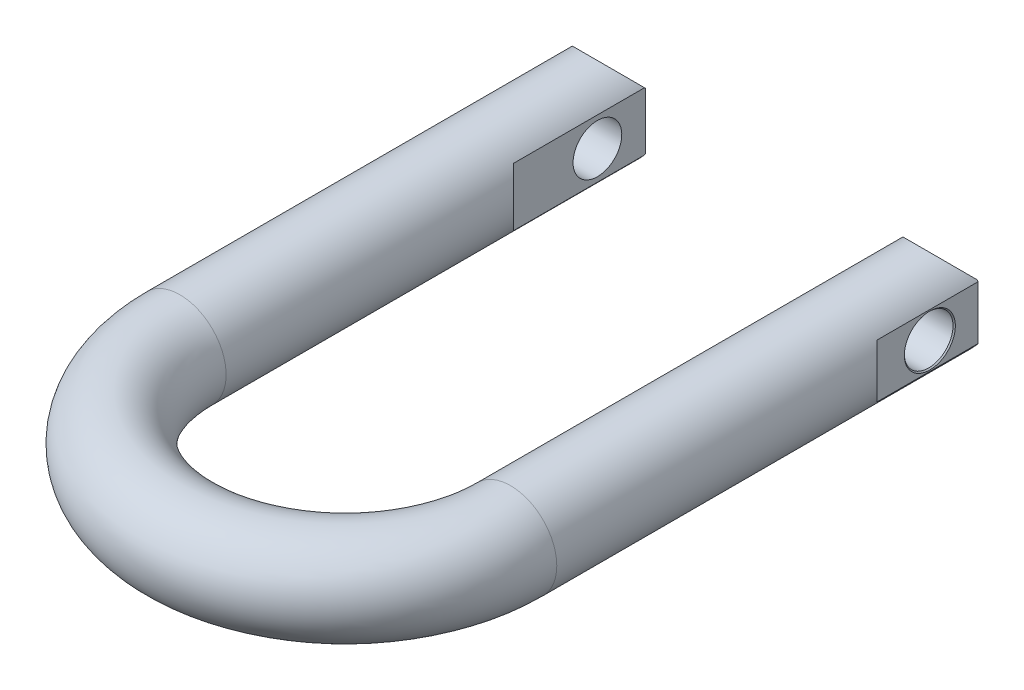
ISO-10303-21;
HEADER;
FILE_DESCRIPTION(('STEP AP214'),'2;1');
FILE_NAME('part.step','',(''),(''),'','','');
FILE_SCHEMA(('AUTOMOTIVE_DESIGN { 1 0 10303 214 1 1 1 1 }'));
ENDSEC;
DATA;
#1=APPLICATION_CONTEXT('core data for automotive mechanical design processes');
#2=APPLICATION_PROTOCOL_DEFINITION('international standard','automotive_design',2000,#1);
#3=PRODUCT_CONTEXT('',#1,'mechanical');
#4=PRODUCT('Part','Part','',(#3));
#5=PRODUCT_RELATED_PRODUCT_CATEGORY('part','',(#4));
#6=PRODUCT_DEFINITION_FORMATION('','',#4);
#7=PRODUCT_DEFINITION_CONTEXT('part definition',#1,'design');
#8=PRODUCT_DEFINITION('design','',#6,#7);
#9=PRODUCT_DEFINITION_SHAPE('','',#8);
#10=(LENGTH_UNIT() NAMED_UNIT(*) SI_UNIT(.MILLI.,.METRE.));
#11=(NAMED_UNIT(*) PLANE_ANGLE_UNIT() SI_UNIT($,.RADIAN.));
#12=(NAMED_UNIT(*) SI_UNIT($,.STERADIAN.) SOLID_ANGLE_UNIT());
#13=UNCERTAINTY_MEASURE_WITH_UNIT(LENGTH_MEASURE(1.E-05),#10,'distance_accuracy_value','');
#14=(GEOMETRIC_REPRESENTATION_CONTEXT(3) GLOBAL_UNCERTAINTY_ASSIGNED_CONTEXT((#13)) GLOBAL_UNIT_ASSIGNED_CONTEXT((#10,
#11,#12)) REPRESENTATION_CONTEXT('',''));
#15=CARTESIAN_POINT('',(0.,0.,0.));
#16=DIRECTION('',(0.,0.,1.));
#17=DIRECTION('',(1.,0.,0.));
#18=AXIS2_PLACEMENT_3D('',#15,#16,#17);
#19=CARTESIAN_POINT('',(96.9518,0.,0.));
#20=DIRECTION('',(-1.,0.,0.));
#21=DIRECTION('',(0.,0.,1.));
#22=AXIS2_PLACEMENT_3D('',#19,#20,#21);
#23=CYLINDRICAL_SURFACE('',#22,11.6967);
#24=CARTESIAN_POINT('',(62.1284,0.,0.));
#25=DIRECTION('',(-1.,0.,0.));
#26=DIRECTION('',(0.,0.,1.));
#27=AXIS2_PLACEMENT_3D('',#24,#25,#26);
#28=CIRCLE('',#27,11.6967);
#29=CARTESIAN_POINT('',(62.1284,0.,11.6967));
#30=VERTEX_POINT('',#29);
#31=EDGE_CURVE('E182',#30,#30,#28,.T.);
#32=ORIENTED_EDGE('',*,*,#31,.T.);
#33=EDGE_LOOP('',(#32));
#34=FACE_BOUND('',#33,.T.);
#35=CARTESIAN_POINT('',(96.9518,0.,0.));
#36=DIRECTION('',(-1.,0.,0.));
#37=DIRECTION('',(0.,-1.,0.));
#38=AXIS2_PLACEMENT_3D('',#35,#36,#37);
#39=CIRCLE('',#38,11.6967);
#40=CARTESIAN_POINT('',(96.9518,-11.6967,0.));
#41=VERTEX_POINT('',#40);
#42=EDGE_CURVE('E156',#41,#41,#39,.F.);
#43=ORIENTED_EDGE('',*,*,#42,.T.);
#44=EDGE_LOOP('',(#43));
#45=FACE_BOUND('',#44,.T.);
#46=ADVANCED_FACE('F14',(#34,#45),#23,.F.);
#47=CARTESIAN_POINT('',(96.9518,0.,0.));
#48=DIRECTION('',(1.,0.,0.));
#49=DIRECTION('',(0.,0.,-1.));
#50=AXIS2_PLACEMENT_3D('',#47,#48,#49);
#51=CONICAL_SURFACE('',#50,11.6967,0.785398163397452);
#52=CARTESIAN_POINT('',(97.5105999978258,0.,0.));
#53=DIRECTION('',(-1.,0.,0.));
#54=DIRECTION('',(0.,0.,1.));
#55=AXIS2_PLACEMENT_3D('',#52,#53,#54);
#56=CIRCLE('',#55,12.2554999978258);
#57=CARTESIAN_POINT('',(97.5105999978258,0.,12.2554999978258));
#58=VERTEX_POINT('',#57);
#59=EDGE_CURVE('E312',#58,#58,#56,.T.);
#60=ORIENTED_EDGE('',*,*,#59,.F.);
#61=EDGE_LOOP('',(#60));
#62=FACE_BOUND('',#61,.T.);
#63=ORIENTED_EDGE('',*,*,#42,.F.);
#64=EDGE_LOOP('',(#63));
#65=FACE_BOUND('',#64,.T.);
#66=ADVANCED_FACE('F269',(#62,#65),#51,.F.);
#67=CARTESIAN_POINT('',(-62.1284,0.,0.));
#68=DIRECTION('',(-1.,0.,0.));
#69=DIRECTION('',(0.,-1.,0.));
#70=AXIS2_PLACEMENT_3D('',#67,#68,#69);
#71=CYLINDRICAL_SURFACE('',#70,11.6967);
#72=CARTESIAN_POINT('',(-62.1284,0.,0.));
#73=DIRECTION('',(-1.,0.,0.));
#74=DIRECTION('',(0.,-1.,0.));
#75=AXIS2_PLACEMENT_3D('',#72,#73,#74);
#76=CIRCLE('',#75,11.6967);
#77=CARTESIAN_POINT('',(-62.1284,-11.6967,0.));
#78=VERTEX_POINT('',#77);
#79=EDGE_CURVE('E144',#78,#78,#76,.F.);
#80=ORIENTED_EDGE('',*,*,#79,.T.);
#81=EDGE_LOOP('',(#80));
#82=FACE_BOUND('',#81,.T.);
#83=CARTESIAN_POINT('',(-96.9518,0.,0.));
#84=DIRECTION('',(-1.,0.,0.));
#85=DIRECTION('',(0.,-1.,0.));
#86=AXIS2_PLACEMENT_3D('',#83,#84,#85);
#87=CIRCLE('',#86,11.6967);
#88=CARTESIAN_POINT('',(-96.9518,-11.6967,0.));
#89=VERTEX_POINT('',#88);
#90=EDGE_CURVE('E152',#89,#89,#87,.F.);
#91=ORIENTED_EDGE('',*,*,#90,.F.);
#92=EDGE_LOOP('',(#91));
#93=FACE_BOUND('',#92,.T.);
#94=ADVANCED_FACE('F276',(#82,#93),#71,.F.);
#95=CARTESIAN_POINT('',(-96.9518,0.,0.));
#96=DIRECTION('',(-1.,0.,0.));
#97=DIRECTION('',(0.,0.,1.));
#98=AXIS2_PLACEMENT_3D('',#95,#96,#97);
#99=CONICAL_SURFACE('',#98,11.6967,0.785398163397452);
#100=CARTESIAN_POINT('',(-97.5105999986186,0.,0.));
#101=DIRECTION('',(1.,0.,0.));
#102=DIRECTION('',(0.,0.,-1.));
#103=AXIS2_PLACEMENT_3D('',#100,#101,#102);
#104=CIRCLE('',#103,12.2554999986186);
#105=CARTESIAN_POINT('',(-97.5105999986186,0.,-12.2554999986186));
#106=VERTEX_POINT('',#105);
#107=EDGE_CURVE('E112',#106,#106,#104,.T.);
#108=ORIENTED_EDGE('',*,*,#107,.F.);
#109=EDGE_LOOP('',(#108));
#110=FACE_BOUND('',#109,.T.);
#111=ORIENTED_EDGE('',*,*,#90,.T.);
#112=EDGE_LOOP('',(#111));
#113=FACE_BOUND('',#112,.T.);
#114=ADVANCED_FACE('F283',(#110,#113),#99,.F.);
#115=CARTESIAN_POINT('',(97.257037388,13.49375,-23.1267));
#116=DIRECTION('',(0.,-0.707106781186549,0.707106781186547));
#117=DIRECTION('',(0.,0.707106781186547,0.707106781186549));
#118=AXIS2_PLACEMENT_3D('',#115,#116,#117);
#119=PLANE('',#118);
#120=DIRECTION('',(1.,0.,0.));
#121=VECTOR('',#120,1.);
#122=CARTESIAN_POINT('',(79.692718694,13.49375,-23.1267));
#123=LINE('',#122,#121);
#124=CARTESIAN_POINT('',(62.1284,13.49375,-23.1267));
#125=VERTEX_POINT('',#124);
#126=CARTESIAN_POINT('',(97.0475226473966,13.49375,-23.1267));
#127=VERTEX_POINT('',#126);
#128=EDGE_CURVE('E109',#125,#127,#123,.T.);
#129=ORIENTED_EDGE('',*,*,#128,.F.);
#130=DIRECTION('',(0.,0.707106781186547,0.707106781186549));
#131=VECTOR('',#130,1.);
#132=CARTESIAN_POINT('',(62.1284,13.49375,-23.1267));
#133=LINE('',#132,#131);
#134=CARTESIAN_POINT('',(62.1283999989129,14.0023993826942,-22.6180506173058));
#135=VERTEX_POINT('',#134);
#136=EDGE_CURVE('E150',#125,#135,#133,.T.);
#137=ORIENTED_EDGE('',*,*,#136,.T.);
#138=CARTESIAN_POINT('',(79.3877,0.,-36.62045));
#139=DIRECTION('',(0.,-0.707106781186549,0.707106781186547));
#140=DIRECTION('',(0.,-0.707106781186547,-0.707106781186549));
#141=AXIS2_PLACEMENT_3D('',#138,#139,#140);
#142=ELLIPSE('',#141,31.430896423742,22.225);
#143=EDGE_CURVE('E130',#135,#127,#142,.F.);
#144=ORIENTED_EDGE('',*,*,#143,.T.);
#145=EDGE_LOOP('',(#129,#137,#144));
#146=FACE_BOUND('',#145,.T.);
#147=ADVANCED_FACE('F287',(#146),#119,.F.);
#148=CARTESIAN_POINT('',(97.5106,-13.0194939,25.2857));
#149=DIRECTION('',(-0.707106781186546,0.,0.707106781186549));
#150=DIRECTION('',(0.707106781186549,0.,0.707106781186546));
#151=AXIS2_PLACEMENT_3D('',#148,#149,#150);
#152=PLANE('',#151);
#153=CARTESIAN_POINT('',(79.3877,0.,7.1628));
#154=DIRECTION('',(-0.707106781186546,0.,0.707106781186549));
#155=DIRECTION('',(-0.707106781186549,0.,-0.707106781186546));
#156=AXIS2_PLACEMENT_3D('',#153,#154,#155);
#157=ELLIPSE('',#156,31.430896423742,22.225);
#158=CARTESIAN_POINT('',(97.5106000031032,12.8651125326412,25.2857000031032));
#159=VERTEX_POINT('',#158);
#160=CARTESIAN_POINT('',(97.5105999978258,-12.8651125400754,25.2856999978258));
#161=VERTEX_POINT('',#160);
#162=EDGE_CURVE('E127',#159,#161,#157,.F.);
#163=ORIENTED_EDGE('',*,*,#162,.T.);
#164=DIRECTION('',(0.,1.,0.));
#165=VECTOR('',#164,1.);
#166=CARTESIAN_POINT('',(97.5106,0.,25.2857));
#167=LINE('',#166,#165);
#168=EDGE_CURVE('E122',#161,#159,#167,.T.);
#169=ORIENTED_EDGE('',*,*,#168,.T.);
#170=EDGE_LOOP('',(#163,#169));
#171=FACE_BOUND('',#170,.T.);
#172=ADVANCED_FACE('F300',(#171),#152,.F.);
#173=CARTESIAN_POINT('',(97.5106,12.8651125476,-23.1267));
#174=DIRECTION('',(-1.,0.,0.));
#175=DIRECTION('',(0.,-1.,0.));
#176=AXIS2_PLACEMENT_3D('',#173,#174,#175);
#177=PLANE('',#176);
#178=DIRECTION('',(0.,0.,1.));
#179=VECTOR('',#178,1.);
#180=CARTESIAN_POINT('',(97.5105999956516,-12.8651125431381,80.0608));
#181=LINE('',#180,#179);
#182=CARTESIAN_POINT('',(97.5105999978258,-12.8651125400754,-23.1267));
#183=VERTEX_POINT('',#182);
#184=EDGE_CURVE('E120',#161,#183,#181,.F.);
#185=ORIENTED_EDGE('',*,*,#184,.T.);
#186=DIRECTION('',(0.,-1.,0.));
#187=VECTOR('',#186,1.);
#188=CARTESIAN_POINT('',(97.5106,0.,-23.1267));
#189=LINE('',#188,#187);
#190=CARTESIAN_POINT('',(97.5106000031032,12.8651125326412,-23.1267));
#191=VERTEX_POINT('',#190);
#192=EDGE_CURVE('E107',#191,#183,#189,.T.);
#193=ORIENTED_EDGE('',*,*,#192,.F.);
#194=DIRECTION('',(0.,0.,-1.));
#195=VECTOR('',#194,1.);
#196=CARTESIAN_POINT('',(97.5106000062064,12.8651125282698,80.0608));
#197=LINE('',#196,#195);
#198=EDGE_CURVE('E117',#191,#159,#197,.F.);
#199=ORIENTED_EDGE('',*,*,#198,.T.);
#200=ORIENTED_EDGE('',*,*,#168,.F.);
#201=EDGE_LOOP('',(#185,#193,#199,#200));
#202=FACE_BOUND('',#201,.T.);
#203=ORIENTED_EDGE('',*,*,#59,.T.);
#204=EDGE_LOOP('',(#203));
#205=FACE_BOUND('',#204,.T.);
#206=ADVANCED_FACE('F114',(#202,#205),#177,.F.);
#207=CARTESIAN_POINT('',(97.5106,-13.49375,-23.1267));
#208=DIRECTION('',(0.,0.,-1.));
#209=DIRECTION('',(-1.,0.,0.));
#210=AXIS2_PLACEMENT_3D('',#207,#208,#209);
#211=PLANE('',#210);
#212=DIRECTION('',(-1.,0.,0.));
#213=VECTOR('',#212,1.);
#214=CARTESIAN_POINT('',(79.692718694,-13.49375,-23.1267));
#215=LINE('',#214,#213);
#216=CARTESIAN_POINT('',(97.0475226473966,-13.49375,-23.1267));
#217=VERTEX_POINT('',#216);
#218=CARTESIAN_POINT('',(62.1284,-13.49375,-23.1267));
#219=VERTEX_POINT('',#218);
#220=EDGE_CURVE('E189',#217,#219,#215,.T.);
#221=ORIENTED_EDGE('',*,*,#220,.T.);
#222=DIRECTION('',(0.,1.,0.));
#223=VECTOR('',#222,1.);
#224=CARTESIAN_POINT('',(62.1284,0.,-23.1267));
#225=LINE('',#224,#223);
#226=EDGE_CURVE('E148',#219,#125,#225,.T.);
#227=ORIENTED_EDGE('',*,*,#226,.T.);
#228=ORIENTED_EDGE('',*,*,#128,.T.);
#229=CARTESIAN_POINT('',(79.3877,0.,-23.1267));
#230=DIRECTION('',(0.,0.,-1.));
#231=DIRECTION('',(0.,-1.,0.));
#232=AXIS2_PLACEMENT_3D('',#229,#230,#231);
#233=CIRCLE('',#232,22.225);
#234=EDGE_CURVE('E18',#127,#191,#233,.T.);
#235=ORIENTED_EDGE('',*,*,#234,.T.);
#236=ORIENTED_EDGE('',*,*,#192,.T.);
#237=CARTESIAN_POINT('',(79.3877,0.,-23.1267));
#238=DIRECTION('',(0.,0.,-1.));
#239=DIRECTION('',(0.,-1.,0.));
#240=AXIS2_PLACEMENT_3D('',#237,#238,#239);
#241=CIRCLE('',#240,22.225);
#242=EDGE_CURVE('E111',#183,#217,#241,.T.);
#243=ORIENTED_EDGE('',*,*,#242,.T.);
#244=EDGE_LOOP('',(#221,#227,#228,#235,#236,#243));
#245=FACE_BOUND('',#244,.T.);
#246=ADVANCED_FACE('F106',(#245),#211,.T.);
#247=CARTESIAN_POINT('',(97.257037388,-22.2773875,-14.3430624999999));
#248=DIRECTION('',(0.,0.707106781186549,0.707106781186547));
#249=DIRECTION('',(0.,0.707106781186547,-0.707106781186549));
#250=AXIS2_PLACEMENT_3D('',#247,#248,#249);
#251=PLANE('',#250);
#252=DIRECTION('',(0.,0.707106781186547,-0.707106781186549));
#253=VECTOR('',#252,1.);
#254=CARTESIAN_POINT('',(62.1284,-22.2773875,-14.3430624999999));
#255=LINE('',#254,#253);
#256=CARTESIAN_POINT('',(62.1284000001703,-14.002399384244,-22.618050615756));
#257=VERTEX_POINT('',#256);
#258=EDGE_CURVE('E151',#257,#219,#255,.T.);
#259=ORIENTED_EDGE('',*,*,#258,.T.);
#260=ORIENTED_EDGE('',*,*,#220,.F.);
#261=CARTESIAN_POINT('',(79.3877,0.,-36.62045));
#262=DIRECTION('',(0.,0.707106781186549,0.707106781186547));
#263=DIRECTION('',(0.,0.707106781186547,-0.707106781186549));
#264=AXIS2_PLACEMENT_3D('',#261,#262,#263);
#265=ELLIPSE('',#264,31.430896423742,22.225);
#266=EDGE_CURVE('E171',#217,#257,#265,.F.);
#267=ORIENTED_EDGE('',*,*,#266,.T.);
#268=EDGE_LOOP('',(#259,#260,#267));
#269=FACE_BOUND('',#268,.T.);
#270=ADVANCED_FACE('F195',(#269),#251,.F.);
#271=CARTESIAN_POINT('',(57.1329058,-14.1704281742,45.3687942));
#272=DIRECTION('',(0.707106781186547,0.,0.707106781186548));
#273=DIRECTION('',(0.707106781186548,0.,-0.707106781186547));
#274=AXIS2_PLACEMENT_3D('',#271,#272,#273);
#275=PLANE('',#274);
#276=CARTESIAN_POINT('',(79.3877,0.,23.114));
#277=DIRECTION('',(0.707106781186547,0.,0.707106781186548));
#278=DIRECTION('',(0.707106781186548,0.,-0.707106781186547));
#279=AXIS2_PLACEMENT_3D('',#276,#277,#278);
#280=ELLIPSE('',#279,31.430896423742,22.225);
#281=CARTESIAN_POINT('',(62.1284000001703,-14.002399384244,40.3732999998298));
#282=VERTEX_POINT('',#281);
#283=CARTESIAN_POINT('',(62.1283999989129,14.0023993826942,40.3733000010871));
#284=VERTEX_POINT('',#283);
#285=EDGE_CURVE('E168',#282,#284,#280,.F.);
#286=ORIENTED_EDGE('',*,*,#285,.T.);
#287=DIRECTION('',(0.,1.,0.));
#288=VECTOR('',#287,1.);
#289=CARTESIAN_POINT('',(62.1284,0.,40.3733));
#290=LINE('',#289,#288);
#291=EDGE_CURVE('E185',#282,#284,#290,.T.);
#292=ORIENTED_EDGE('',*,*,#291,.F.);
#293=EDGE_LOOP('',(#286,#292));
#294=FACE_BOUND('',#293,.T.);
#295=ADVANCED_FACE('F263',(#294),#275,.F.);
#296=CARTESIAN_POINT('',(62.1284,-14.0023993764,40.3733));
#297=DIRECTION('',(1.,0.,0.));
#298=DIRECTION('',(0.,0.,-1.));
#299=AXIS2_PLACEMENT_3D('',#296,#297,#298);
#300=PLANE('',#299);
#301=ORIENTED_EDGE('',*,*,#31,.F.);
#302=EDGE_LOOP('',(#301));
#303=FACE_BOUND('',#302,.T.);
#304=ORIENTED_EDGE('',*,*,#136,.F.);
#305=ORIENTED_EDGE('',*,*,#226,.F.);
#306=ORIENTED_EDGE('',*,*,#258,.F.);
#307=DIRECTION('',(0.,0.,-1.));
#308=VECTOR('',#307,1.);
#309=CARTESIAN_POINT('',(62.1284000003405,-14.0023993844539,80.0608));
#310=LINE('',#309,#308);
#311=EDGE_CURVE('E170',#257,#282,#310,.F.);
#312=ORIENTED_EDGE('',*,*,#311,.T.);
#313=ORIENTED_EDGE('',*,*,#291,.T.);
#314=DIRECTION('',(0.,0.,1.));
#315=VECTOR('',#314,1.);
#316=CARTESIAN_POINT('',(62.1283999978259,14.0023993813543,80.0608));
#317=LINE('',#316,#315);
#318=EDGE_CURVE('E134',#284,#135,#317,.F.);
#319=ORIENTED_EDGE('',*,*,#318,.T.);
#320=EDGE_LOOP('',(#304,#305,#306,#312,#313,#319));
#321=FACE_BOUND('',#320,.T.);
#322=ADVANCED_FACE('F254',(#303,#321),#300,.F.);
#323=CARTESIAN_POINT('',(-62.1284,13.49375,-23.1267));
#324=DIRECTION('',(0.,-0.707106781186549,0.707106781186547));
#325=DIRECTION('',(0.,0.707106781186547,0.707106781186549));
#326=AXIS2_PLACEMENT_3D('',#323,#324,#325);
#327=PLANE('',#326);
#328=DIRECTION('',(0.,0.707106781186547,0.707106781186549));
#329=VECTOR('',#328,1.);
#330=CARTESIAN_POINT('',(-62.1284,13.49375,-23.1267));
#331=LINE('',#330,#329);
#332=CARTESIAN_POINT('',(-62.1284000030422,14.0023993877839,-22.6180506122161));
#333=VERTEX_POINT('',#332);
#334=CARTESIAN_POINT('',(-62.1284,13.49375,-23.1267));
#335=VERTEX_POINT('',#334);
#336=EDGE_CURVE('E145',#333,#335,#331,.F.);
#337=ORIENTED_EDGE('',*,*,#336,.T.);
#338=DIRECTION('',(1.,0.,0.));
#339=VECTOR('',#338,1.);
#340=CARTESIAN_POINT('',(-79.692718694,13.49375,-23.1267));
#341=LINE('',#340,#339);
#342=CARTESIAN_POINT('',(-97.0475226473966,13.49375,-23.1267));
#343=VERTEX_POINT('',#342);
#344=EDGE_CURVE('E123',#343,#335,#341,.T.);
#345=ORIENTED_EDGE('',*,*,#344,.F.);
#346=CARTESIAN_POINT('',(-79.3877,0.,-36.62045));
#347=DIRECTION('',(0.,-0.707106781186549,0.707106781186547));
#348=DIRECTION('',(0.,-0.707106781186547,-0.707106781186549));
#349=AXIS2_PLACEMENT_3D('',#346,#347,#348);
#350=ELLIPSE('',#349,31.430896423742,22.225);
#351=EDGE_CURVE('E132',#343,#333,#350,.F.);
#352=ORIENTED_EDGE('',*,*,#351,.T.);
#353=EDGE_LOOP('',(#337,#345,#352));
#354=FACE_BOUND('',#353,.T.);
#355=ADVANCED_FACE('F252',(#354),#327,.F.);
#356=CARTESIAN_POINT('',(-62.1284,-14.1704281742,40.3733));
#357=DIRECTION('',(-0.707106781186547,0.,0.707106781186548));
#358=DIRECTION('',(0.707106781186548,0.,0.707106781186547));
#359=AXIS2_PLACEMENT_3D('',#356,#357,#358);
#360=PLANE('',#359);
#361=DIRECTION('',(0.,1.,0.));
#362=VECTOR('',#361,1.);
#363=CARTESIAN_POINT('',(-62.1284,0.,40.3733));
#364=LINE('',#363,#362);
#365=CARTESIAN_POINT('',(-62.1284000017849,-14.0023993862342,40.3732999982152));
#366=VERTEX_POINT('',#365);
#367=CARTESIAN_POINT('',(-62.1284000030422,14.0023993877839,40.3732999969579));
#368=VERTEX_POINT('',#367);
#369=EDGE_CURVE('E181',#366,#368,#364,.T.);
#370=ORIENTED_EDGE('',*,*,#369,.T.);
#371=CARTESIAN_POINT('',(-79.3877,0.,23.114));
#372=DIRECTION('',(-0.707106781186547,0.,0.707106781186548));
#373=DIRECTION('',(-0.707106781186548,0.,-0.707106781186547));
#374=AXIS2_PLACEMENT_3D('',#371,#372,#373);
#375=ELLIPSE('',#374,31.430896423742,22.225);
#376=EDGE_CURVE('E166',#368,#366,#375,.F.);
#377=ORIENTED_EDGE('',*,*,#376,.T.);
#378=EDGE_LOOP('',(#370,#377));
#379=FACE_BOUND('',#378,.T.);
#380=ADVANCED_FACE('F224',(#379),#360,.F.);
#381=CARTESIAN_POINT('',(-62.1284,-14.0023993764,-23.1267));
#382=DIRECTION('',(-1.,0.,0.));
#383=DIRECTION('',(0.,0.,1.));
#384=AXIS2_PLACEMENT_3D('',#381,#382,#383);
#385=PLANE('',#384);
#386=ORIENTED_EDGE('',*,*,#79,.F.);
#387=EDGE_LOOP('',(#386));
#388=FACE_BOUND('',#387,.T.);
#389=ORIENTED_EDGE('',*,*,#336,.F.);
#390=DIRECTION('',(0.,0.,-1.));
#391=VECTOR('',#390,1.);
#392=CARTESIAN_POINT('',(-62.1284000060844,14.0023993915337,80.0608));
#393=LINE('',#392,#391);
#394=EDGE_CURVE('E174',#333,#368,#393,.F.);
#395=ORIENTED_EDGE('',*,*,#394,.T.);
#396=ORIENTED_EDGE('',*,*,#369,.F.);
#397=DIRECTION('',(0.,0.,1.));
#398=VECTOR('',#397,1.);
#399=CARTESIAN_POINT('',(-62.1284000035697,-14.0023993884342,80.0608));
#400=LINE('',#399,#398);
#401=CARTESIAN_POINT('',(-62.1284000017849,-14.0023993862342,-22.6180506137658));
#402=VERTEX_POINT('',#401);
#403=EDGE_CURVE('E165',#366,#402,#400,.F.);
#404=ORIENTED_EDGE('',*,*,#403,.T.);
#405=DIRECTION('',(0.,0.707106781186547,-0.707106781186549));
#406=VECTOR('',#405,1.);
#407=CARTESIAN_POINT('',(-62.1284,-17.88556875,-18.73488125));
#408=LINE('',#407,#406);
#409=CARTESIAN_POINT('',(-62.1284,-13.4937499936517,-23.1267));
#410=VERTEX_POINT('',#409);
#411=EDGE_CURVE('E178',#402,#410,#408,.T.);
#412=ORIENTED_EDGE('',*,*,#411,.T.);
#413=DIRECTION('',(0.,-1.,0.));
#414=VECTOR('',#413,1.);
#415=CARTESIAN_POINT('',(-62.1284,0.,-23.1267));
#416=LINE('',#415,#414);
#417=EDGE_CURVE('E141',#335,#410,#416,.T.);
#418=ORIENTED_EDGE('',*,*,#417,.F.);
#419=EDGE_LOOP('',(#389,#395,#396,#404,#412,#418));
#420=FACE_BOUND('',#419,.T.);
#421=ADVANCED_FACE('F214',(#388,#420),#385,.F.);
#422=CARTESIAN_POINT('',(-62.1284,-22.2773875,-14.3430624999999));
#423=DIRECTION('',(0.,0.707106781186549,0.707106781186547));
#424=DIRECTION('',(0.,0.707106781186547,-0.707106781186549));
#425=AXIS2_PLACEMENT_3D('',#422,#423,#424);
#426=PLANE('',#425);
#427=ORIENTED_EDGE('',*,*,#411,.F.);
#428=CARTESIAN_POINT('',(-79.3877,0.,-36.62045));
#429=DIRECTION('',(0.,0.707106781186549,0.707106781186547));
#430=DIRECTION('',(0.,0.707106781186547,-0.707106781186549));
#431=AXIS2_PLACEMENT_3D('',#428,#429,#430);
#432=ELLIPSE('',#431,31.430896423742,22.225);
#433=CARTESIAN_POINT('',(-97.0475226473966,-13.49375,-23.1267));
#434=VERTEX_POINT('',#433);
#435=EDGE_CURVE('E162',#402,#434,#432,.F.);
#436=ORIENTED_EDGE('',*,*,#435,.T.);
#437=DIRECTION('',(-1.,0.,0.));
#438=VECTOR('',#437,1.);
#439=CARTESIAN_POINT('',(-79.692718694,-13.49375,-23.1267));
#440=LINE('',#439,#438);
#441=EDGE_CURVE('E228',#410,#434,#440,.T.);
#442=ORIENTED_EDGE('',*,*,#441,.F.);
#443=EDGE_LOOP('',(#427,#436,#442));
#444=FACE_BOUND('',#443,.T.);
#445=ADVANCED_FACE('F246',(#444),#426,.F.);
#446=CARTESIAN_POINT('',(-97.5106,-13.49375,-23.1267));
#447=DIRECTION('',(0.,0.,1.));
#448=DIRECTION('',(1.,0.,0.));
#449=AXIS2_PLACEMENT_3D('',#446,#447,#448);
#450=PLANE('',#449);
#451=ORIENTED_EDGE('',*,*,#344,.T.);
#452=ORIENTED_EDGE('',*,*,#417,.T.);
#453=ORIENTED_EDGE('',*,*,#441,.T.);
#454=CARTESIAN_POINT('',(-79.3877,0.,-23.1267));
#455=DIRECTION('',(0.,0.,-1.));
#456=DIRECTION('',(0.,-1.,0.));
#457=AXIS2_PLACEMENT_3D('',#454,#455,#456);
#458=CIRCLE('',#457,22.225);
#459=CARTESIAN_POINT('',(-97.5105999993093,-12.8651125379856,-23.1267));
#460=VERTEX_POINT('',#459);
#461=EDGE_CURVE('E159',#460,#434,#458,.F.);
#462=ORIENTED_EDGE('',*,*,#461,.F.);
#463=DIRECTION('',(0.,1.,0.));
#464=VECTOR('',#463,1.);
#465=CARTESIAN_POINT('',(-97.5106,0.,-23.1267));
#466=LINE('',#465,#464);
#467=CARTESIAN_POINT('',(-97.5106000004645,12.8651125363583,-23.1267));
#468=VERTEX_POINT('',#467);
#469=EDGE_CURVE('E231',#460,#468,#466,.T.);
#470=ORIENTED_EDGE('',*,*,#469,.T.);
#471=CARTESIAN_POINT('',(-79.3877,0.,-23.1267));
#472=DIRECTION('',(0.,0.,-1.));
#473=DIRECTION('',(0.,-1.,0.));
#474=AXIS2_PLACEMENT_3D('',#471,#472,#473);
#475=CIRCLE('',#474,22.225);
#476=EDGE_CURVE('E155',#343,#468,#475,.F.);
#477=ORIENTED_EDGE('',*,*,#476,.F.);
#478=EDGE_LOOP('',(#451,#452,#453,#462,#470,#477));
#479=FACE_BOUND('',#478,.T.);
#480=ADVANCED_FACE('F249',(#479),#450,.F.);
#481=CARTESIAN_POINT('',(-97.5106,-12.8651125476,25.2857));
#482=DIRECTION('',(1.,0.,0.));
#483=DIRECTION('',(0.,0.,-1.));
#484=AXIS2_PLACEMENT_3D('',#481,#482,#483);
#485=PLANE('',#484);
#486=DIRECTION('',(0.,0.,-1.));
#487=VECTOR('',#486,1.);
#488=CARTESIAN_POINT('',(-97.5105999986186,-12.8651125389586,80.0608));
#489=LINE('',#488,#487);
#490=CARTESIAN_POINT('',(-97.5105999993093,-12.8651125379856,25.2856999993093));
#491=VERTEX_POINT('',#490);
#492=EDGE_CURVE('E33',#460,#491,#489,.F.);
#493=ORIENTED_EDGE('',*,*,#492,.T.);
#494=DIRECTION('',(0.,1.,0.));
#495=VECTOR('',#494,1.);
#496=CARTESIAN_POINT('',(-97.5106,0.,25.2857));
#497=LINE('',#496,#495);
#498=CARTESIAN_POINT('',(-97.5106000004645,12.8651125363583,25.2857000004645));
#499=VERTEX_POINT('',#498);
#500=EDGE_CURVE('E140',#491,#499,#497,.T.);
#501=ORIENTED_EDGE('',*,*,#500,.T.);
#502=DIRECTION('',(0.,0.,1.));
#503=VECTOR('',#502,1.);
#504=CARTESIAN_POINT('',(-97.510600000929,12.865112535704,80.0608));
#505=LINE('',#504,#503);
#506=EDGE_CURVE('E129',#499,#468,#505,.F.);
#507=ORIENTED_EDGE('',*,*,#506,.T.);
#508=ORIENTED_EDGE('',*,*,#469,.F.);
#509=EDGE_LOOP('',(#493,#501,#507,#508));
#510=FACE_BOUND('',#509,.T.);
#511=ORIENTED_EDGE('',*,*,#107,.T.);
#512=EDGE_LOOP('',(#511));
#513=FACE_BOUND('',#512,.T.);
#514=ADVANCED_FACE('F298',(#510,#513),#485,.F.);
#515=CARTESIAN_POINT('',(-101.6373126,-13.0194939,29.4124126));
#516=DIRECTION('',(0.707106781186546,0.,0.707106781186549));
#517=DIRECTION('',(0.707106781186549,0.,-0.707106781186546));
#518=AXIS2_PLACEMENT_3D('',#515,#516,#517);
#519=PLANE('',#518);
#520=CARTESIAN_POINT('',(-79.3877,0.,7.1628));
#521=DIRECTION('',(0.707106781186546,0.,0.707106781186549));
#522=DIRECTION('',(0.707106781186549,0.,-0.707106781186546));
#523=AXIS2_PLACEMENT_3D('',#520,#521,#522);
#524=ELLIPSE('',#523,31.430896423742,22.225);
#525=EDGE_CURVE('E160',#491,#499,#524,.F.);
#526=ORIENTED_EDGE('',*,*,#525,.T.);
#527=ORIENTED_EDGE('',*,*,#500,.F.);
#528=EDGE_LOOP('',(#526,#527));
#529=FACE_BOUND('',#528,.T.);
#530=ADVANCED_FACE('F334',(#529),#519,.F.);
#531=CARTESIAN_POINT('',(0.,0.,183.2483));
#532=DIRECTION('',(0.,-1.,0.));
#533=DIRECTION('',(1.,0.,0.));
#534=AXIS2_PLACEMENT_3D('',#531,#532,#533);
#535=TOROIDAL_SURFACE('',#534,79.3877,22.225);
#536=CARTESIAN_POINT('',(79.3877,0.,183.2483));
#537=DIRECTION('',(0.,0.,1.));
#538=DIRECTION('',(0.,1.,0.));
#539=AXIS2_PLACEMENT_3D('',#536,#537,#538);
#540=CIRCLE('',#539,22.225);
#541=CARTESIAN_POINT('',(101.6127,0.,183.2483));
#542=VERTEX_POINT('',#541);
#543=EDGE_CURVE('E24',#542,#542,#540,.T.);
#544=CARTESIAN_POINT('',(-79.3877,0.,183.2483));
#545=DIRECTION('',(0.,0.,1.));
#546=DIRECTION('',(0.,1.,0.));
#547=AXIS2_PLACEMENT_3D('',#544,#545,#546);
#548=CIRCLE('',#547,22.225);
#549=CARTESIAN_POINT('',(-101.6127,0.,183.2483));
#550=VERTEX_POINT('',#549);
#551=EDGE_CURVE('E9',#550,#550,#548,.T.);
#552=CARTESIAN_POINT('',(0.,0.,183.2483));
#553=DIRECTION('',(0.,-1.,0.));
#554=DIRECTION('',(1.,0.,0.));
#555=AXIS2_PLACEMENT_3D('',#552,#553,#554);
#556=CIRCLE('',#555,101.6127);
#557=EDGE_CURVE('',#542,#550,#556,.T.);
#558=ORIENTED_EDGE('',*,*,#543,.T.);
#559=ORIENTED_EDGE('',*,*,#551,.T.);
#560=ORIENTED_EDGE('',*,*,#557,.T.);
#561=ORIENTED_EDGE('',*,*,#557,.F.);
#562=EDGE_LOOP('',(#558,#560,#559,#561));
#563=FACE_BOUND('',#562,.T.);
#564=ADVANCED_FACE('F16',(#563),#535,.T.);
#565=CARTESIAN_POINT('',(-79.3877,0.,183.2483));
#566=DIRECTION('',(0.,0.,-1.));
#567=DIRECTION('',(0.,-1.,0.));
#568=AXIS2_PLACEMENT_3D('',#565,#566,#567);
#569=CYLINDRICAL_SURFACE('',#568,22.225);
#570=ORIENTED_EDGE('',*,*,#551,.F.);
#571=EDGE_LOOP('',(#570));
#572=FACE_BOUND('',#571,.T.);
#573=ORIENTED_EDGE('',*,*,#506,.F.);
#574=ORIENTED_EDGE('',*,*,#525,.F.);
#575=ORIENTED_EDGE('',*,*,#492,.F.);
#576=ORIENTED_EDGE('',*,*,#461,.T.);
#577=ORIENTED_EDGE('',*,*,#435,.F.);
#578=ORIENTED_EDGE('',*,*,#403,.F.);
#579=ORIENTED_EDGE('',*,*,#376,.F.);
#580=ORIENTED_EDGE('',*,*,#394,.F.);
#581=ORIENTED_EDGE('',*,*,#351,.F.);
#582=ORIENTED_EDGE('',*,*,#476,.T.);
#583=EDGE_LOOP('',(#573,#574,#575,#576,#577,#578,#579,#580,#581,#582));
#584=FACE_BOUND('',#583,.T.);
#585=ADVANCED_FACE('F221',(#572,#584),#569,.T.);
#586=CARTESIAN_POINT('',(79.3877,0.,183.2483));
#587=DIRECTION('',(0.,0.,-1.));
#588=DIRECTION('',(0.,-1.,0.));
#589=AXIS2_PLACEMENT_3D('',#586,#587,#588);
#590=CYLINDRICAL_SURFACE('',#589,22.225);
#591=ORIENTED_EDGE('',*,*,#543,.F.);
#592=EDGE_LOOP('',(#591));
#593=FACE_BOUND('',#592,.T.);
#594=ORIENTED_EDGE('',*,*,#318,.F.);
#595=ORIENTED_EDGE('',*,*,#285,.F.);
#596=ORIENTED_EDGE('',*,*,#311,.F.);
#597=ORIENTED_EDGE('',*,*,#266,.F.);
#598=ORIENTED_EDGE('',*,*,#242,.F.);
#599=ORIENTED_EDGE('',*,*,#184,.F.);
#600=ORIENTED_EDGE('',*,*,#162,.F.);
#601=ORIENTED_EDGE('',*,*,#198,.F.);
#602=ORIENTED_EDGE('',*,*,#234,.F.);
#603=ORIENTED_EDGE('',*,*,#143,.F.);
#604=EDGE_LOOP('',(#594,#595,#596,#597,#598,#599,#600,#601,#602,#603));
#605=FACE_BOUND('',#604,.T.);
#606=ADVANCED_FACE('F126',(#593,#605),#590,.T.);
#607=CLOSED_SHELL('',(#46,#66,#94,#114,#147,#172,#206,#246,#270,#295,#322,#355,#380,#421,#445,
#480,#514,#530,#564,#585,#606));
#608=MANIFOLD_SOLID_BREP('B1',#607);
#609=ADVANCED_BREP_SHAPE_REPRESENTATION('',(#18,#608),#14);
#610=SHAPE_DEFINITION_REPRESENTATION(#9,#609);
ENDSEC;
END-ISO-10303-21;
